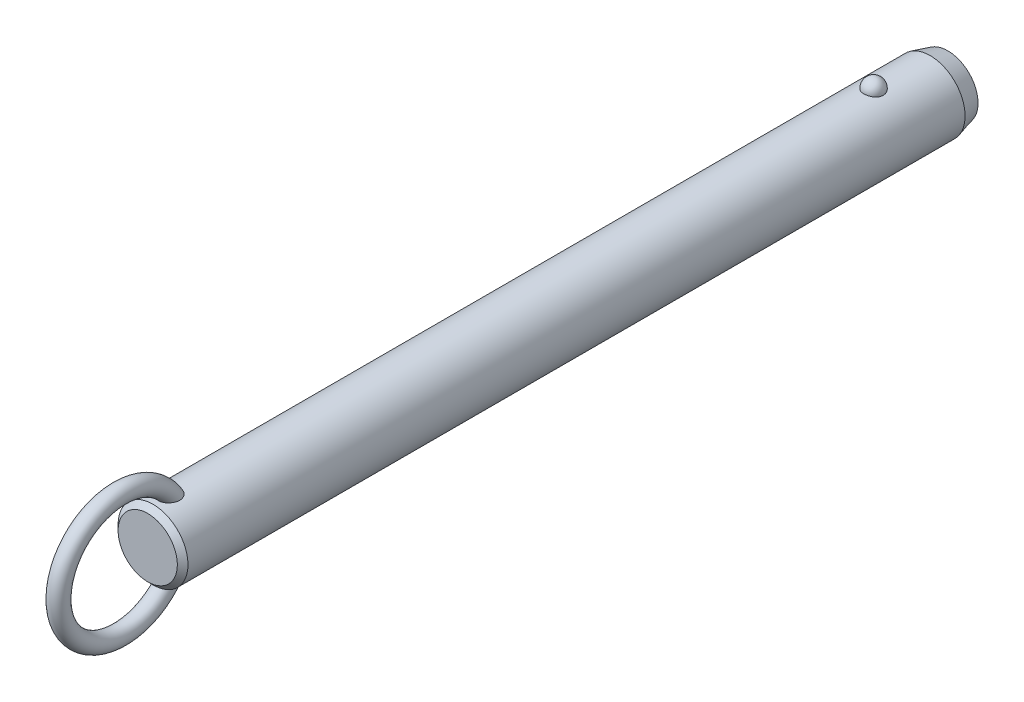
ISO-10303-21;
HEADER;
FILE_DESCRIPTION(('STEP AP214'),'2;1');
FILE_NAME('part.step','',(''),(''),'','','');
FILE_SCHEMA(('AUTOMOTIVE_DESIGN { 1 0 10303 214 1 1 1 1 }'));
ENDSEC;
DATA;
#1=APPLICATION_CONTEXT('core data for automotive mechanical design processes');
#2=APPLICATION_PROTOCOL_DEFINITION('international standard','automotive_design',2000,#1);
#3=PRODUCT_CONTEXT('',#1,'mechanical');
#4=PRODUCT('Part','Part','',(#3));
#5=PRODUCT_RELATED_PRODUCT_CATEGORY('part','',(#4));
#6=PRODUCT_DEFINITION_FORMATION('','',#4);
#7=PRODUCT_DEFINITION_CONTEXT('part definition',#1,'design');
#8=PRODUCT_DEFINITION('design','',#6,#7);
#9=PRODUCT_DEFINITION_SHAPE('','',#8);
#10=(LENGTH_UNIT() NAMED_UNIT(*) SI_UNIT(.MILLI.,.METRE.));
#11=(NAMED_UNIT(*) PLANE_ANGLE_UNIT() SI_UNIT($,.RADIAN.));
#12=(NAMED_UNIT(*) SI_UNIT($,.STERADIAN.) SOLID_ANGLE_UNIT());
#13=UNCERTAINTY_MEASURE_WITH_UNIT(LENGTH_MEASURE(1.E-05),#10,'distance_accuracy_value','');
#14=(GEOMETRIC_REPRESENTATION_CONTEXT(3) GLOBAL_UNCERTAINTY_ASSIGNED_CONTEXT((#13)) GLOBAL_UNIT_ASSIGNED_CONTEXT((#10,
#11,#12)) REPRESENTATION_CONTEXT('',''));
#15=CARTESIAN_POINT('',(0.,0.,0.));
#16=DIRECTION('',(0.,0.,1.));
#17=DIRECTION('',(1.,0.,0.));
#18=AXIS2_PLACEMENT_3D('',#15,#16,#17);
#19=CARTESIAN_POINT('',(0.,0.,152.4));
#20=DIRECTION('',(0.,0.,-1.));
#21=DIRECTION('',(-1.,0.,0.));
#22=AXIS2_PLACEMENT_3D('',#19,#20,#21);
#23=CYLINDRICAL_SURFACE('',#22,7.9);
#24=CARTESIAN_POINT('',(2.1785689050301,7.59367088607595,-2.19999999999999));
#25=CARTESIAN_POINT('',(2.17856679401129,7.59367269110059,-2.07701843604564));
#26=CARTESIAN_POINT('',(2.16853481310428,7.59657145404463,-1.95401006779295));
#27=CARTESIAN_POINT('',(2.12864689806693,7.607843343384,-1.71147811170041));
#28=CARTESIAN_POINT('',(2.09878338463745,7.61621856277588,-1.59195587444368));
#29=CARTESIAN_POINT('',(2.0199931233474,7.63749180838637,-1.3598563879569));
#30=CARTESIAN_POINT('',(1.97107475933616,7.65038784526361,-1.24727610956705));
#31=CARTESIAN_POINT('',(1.85539377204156,7.67926115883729,-1.03213234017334));
#32=CARTESIAN_POINT('',(1.78863158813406,7.69523835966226,-0.929568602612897));
#33=CARTESIAN_POINT('',(1.63856494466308,7.7285848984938,-0.736786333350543));
#34=CARTESIAN_POINT('',(1.55518140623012,7.7459606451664,-0.646630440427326));
#35=CARTESIAN_POINT('',(1.37422937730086,7.78009978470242,-0.481747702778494));
#36=CARTESIAN_POINT('',(1.27666086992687,7.79686317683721,-0.407020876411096));
#37=CARTESIAN_POINT('',(1.07024728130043,7.82786153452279,-0.275278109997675));
#38=CARTESIAN_POINT('',(0.961434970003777,7.84210353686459,-0.218212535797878));
#39=CARTESIAN_POINT('',(0.735351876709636,7.86652194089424,-0.123146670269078));
#40=CARTESIAN_POINT('',(0.618082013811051,7.87669878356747,-0.0851443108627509));
#41=CARTESIAN_POINT('',(0.380637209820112,7.89170521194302,-0.0298158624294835));
#42=CARTESIAN_POINT('',(0.260550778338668,7.89662650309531,-0.0121347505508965));
#43=CARTESIAN_POINT('',(0.019011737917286,7.90090003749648,0.00324379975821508));
#44=CARTESIAN_POINT('',(-0.10244074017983,7.90025280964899,0.000943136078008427));
#45=CARTESIAN_POINT('',(-0.341452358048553,7.89351056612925,-0.0233955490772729));
#46=CARTESIAN_POINT('',(-0.459042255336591,7.88749257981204,-0.0451545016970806));
#47=CARTESIAN_POINT('',(-0.688796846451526,7.87075812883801,-0.107408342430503));
#48=CARTESIAN_POINT('',(-0.800961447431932,7.86004158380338,-0.147903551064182));
#49=CARTESIAN_POINT('',(-1.01743634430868,7.83497131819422,-0.246799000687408));
#50=CARTESIAN_POINT('',(-1.12169791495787,7.82059709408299,-0.305300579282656));
#51=CARTESIAN_POINT('',(-1.31891765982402,7.78976470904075,-0.43854939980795));
#52=CARTESIAN_POINT('',(-1.41187469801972,7.77330633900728,-0.513298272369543));
#53=CARTESIAN_POINT('',(-1.58577142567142,7.73972434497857,-0.678622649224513));
#54=CARTESIAN_POINT('',(-1.66645140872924,7.72259402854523,-0.769470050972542));
#55=CARTESIAN_POINT('',(-1.81161503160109,7.68983776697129,-0.963538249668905));
#56=CARTESIAN_POINT('',(-1.87609753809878,7.6742119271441,-1.06675991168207));
#57=CARTESIAN_POINT('',(-1.98790138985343,7.6460202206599,-1.28401170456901));
#58=CARTESIAN_POINT('',(-2.03501994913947,7.63349104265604,-1.39815107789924));
#59=CARTESIAN_POINT('',(-2.10986724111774,7.6131449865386,-1.63301784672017));
#60=CARTESIAN_POINT('',(-2.1375965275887,7.60532797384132,-1.75374505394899));
#61=CARTESIAN_POINT('',(-2.17289256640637,7.5953195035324,-1.99782562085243));
#62=CARTESIAN_POINT('',(-2.18054294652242,7.59310471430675,-2.12116592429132));
#63=CARTESIAN_POINT('',(-2.17572919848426,7.59448538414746,-2.36741799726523));
#64=CARTESIAN_POINT('',(-2.1632656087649,7.59808068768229,-2.49032977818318));
#65=CARTESIAN_POINT('',(-2.11865035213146,7.61064035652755,-2.73161015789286));
#66=CARTESIAN_POINT('',(-2.08659579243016,7.61957823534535,-2.84999812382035));
#67=CARTESIAN_POINT('',(-2.00367799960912,7.64179982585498,-3.07955956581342));
#68=CARTESIAN_POINT('',(-1.9528140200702,7.65508371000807,-3.19073275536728));
#69=CARTESIAN_POINT('',(-1.83321113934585,7.68460381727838,-3.40337899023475));
#70=CARTESIAN_POINT('',(-1.76437735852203,7.70085556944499,-3.50479651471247));
#71=CARTESIAN_POINT('',(-1.61069526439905,7.73445734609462,-3.69446912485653));
#72=CARTESIAN_POINT('',(-1.52584634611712,7.75180741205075,-3.78272371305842));
#73=CARTESIAN_POINT('',(-1.34198059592,7.78574608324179,-3.94393987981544));
#74=CARTESIAN_POINT('',(-1.24291308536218,7.80233167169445,-4.01684434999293));
#75=CARTESIAN_POINT('',(-1.03352039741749,7.83281625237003,-4.14489386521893));
#76=CARTESIAN_POINT('',(-0.923196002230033,7.84671543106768,-4.20004014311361));
#77=CARTESIAN_POINT('',(-0.69582211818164,7.87011575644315,-4.29042017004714));
#78=CARTESIAN_POINT('',(-0.578872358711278,7.87966903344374,-4.32589112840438));
#79=CARTESIAN_POINT('',(-0.34041023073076,7.8935652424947,-4.37692226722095));
#80=CARTESIAN_POINT('',(-0.218898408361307,7.89790879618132,-4.39248482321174));
#81=CARTESIAN_POINT('',(0.0228107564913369,7.90087453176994,-4.40314405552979));
#82=CARTESIAN_POINT('',(0.142990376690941,7.89960185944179,-4.39861683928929));
#83=CARTESIAN_POINT('',(0.380829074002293,7.89171262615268,-4.37008293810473));
#84=CARTESIAN_POINT('',(0.498488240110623,7.8850962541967,-4.34607694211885));
#85=CARTESIAN_POINT('',(0.727535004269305,7.86726442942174,-4.27939317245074));
#86=CARTESIAN_POINT('',(0.838944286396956,7.85606616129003,-4.236785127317));
#87=CARTESIAN_POINT('',(1.05295421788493,7.83025654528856,-4.13408348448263));
#88=CARTESIAN_POINT('',(1.15555431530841,7.81564498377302,-4.07398879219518));
#89=CARTESIAN_POINT('',(1.35076763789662,7.7843022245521,-3.93687432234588));
#90=CARTESIAN_POINT('',(1.4432046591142,7.76754209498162,-3.85961036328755));
#91=CARTESIAN_POINT('',(1.6139111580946,7.73387857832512,-3.69076949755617));
#92=CARTESIAN_POINT('',(1.6921781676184,7.71697516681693,-3.59919010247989));
#93=CARTESIAN_POINT('',(1.83380875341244,7.6845643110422,-3.40247278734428));
#94=CARTESIAN_POINT('',(1.89689280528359,7.66908588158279,-3.29712873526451));
#95=CARTESIAN_POINT('',(2.0047823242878,7.64159441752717,-3.07707931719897));
#96=CARTESIAN_POINT('',(2.0495945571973,7.62958010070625,-2.96237743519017));
#97=CARTESIAN_POINT('',(2.11580183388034,7.61146617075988,-2.74040519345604));
#98=CARTESIAN_POINT('',(2.13929812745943,7.60484503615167,-2.63379846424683));
#99=CARTESIAN_POINT('',(2.17068242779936,7.59594664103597,-2.41813481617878));
#100=CARTESIAN_POINT('',(2.17857077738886,7.59366928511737,-2.30907795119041));
#101=CARTESIAN_POINT('',(2.1785689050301,7.59367088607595,-2.19999999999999));
#102=B_SPLINE_CURVE_WITH_KNOTS('',3,(#24,#25,#26,#27,#28,#29,#30,#31,#32,#33,#34,#35,#36,#37,
#38,#39,#40,#41,#42,#43,#44,#45,#46,#47,#48,#49,#50,#51,#52,#53,#54,#55,#56,#57,#58,#59,#60,#61,
#62,#63,#64,#65,#66,#67,#68,#69,#70,#71,#72,#73,#74,#75,#76,#77,#78,#79,#80,#81,#82,#83,#84,#85,
#86,#87,#88,#89,#90,#91,#92,#93,#94,#95,#96,#97,#98,#99,#100,#101),.UNSPECIFIED.,.T.,.F.,(4,2,2,
2,2,2,2,2,2,2,2,2,2,2,2,2,2,2,2,2,2,2,2,2,2,2,2,2,2,2,2,2,2,2,2,2,2,2,4),(0.,0.368552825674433,
0.737246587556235,1.10577831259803,1.4743009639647,1.84462067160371,2.21494081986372,
2.58421058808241,2.95344028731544,3.31611630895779,3.67875788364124,4.03628044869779,
4.39380913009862,4.75338791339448,5.11300280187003,5.47939989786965,5.8458226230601,
6.21639834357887,6.58696347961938,6.95598276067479,7.32499216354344,7.69218715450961,
8.0593967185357,8.42858578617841,8.79778880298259,9.16834203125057,9.5388695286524,
9.90482699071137,10.2707407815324,10.6298333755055,10.9889132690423,11.3466585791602,
11.7044262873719,12.0676511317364,12.4309391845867,12.8004764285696,13.1698767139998,
13.4967701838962,13.8236564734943),.UNSPECIFIED.);
#103=CARTESIAN_POINT('',(2.1785689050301,7.59367088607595,-2.19999999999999));
#104=VERTEX_POINT('',#103);
#105=EDGE_CURVE('E41',#104,#104,#102,.T.);
#106=ORIENTED_EDGE('',*,*,#105,.T.);
#107=EDGE_LOOP('',(#106));
#108=FACE_BOUND('',#107,.T.);
#109=CARTESIAN_POINT('',(0.,0.,160.72));
#110=DIRECTION('',(0.,0.,1.));
#111=DIRECTION('',(1.,0.,0.));
#112=AXIS2_PLACEMENT_3D('',#109,#110,#111);
#113=CIRCLE('',#112,7.9);
#114=CARTESIAN_POINT('',(7.9,0.,160.72));
#115=VERTEX_POINT('',#114);
#116=EDGE_CURVE('E10',#115,#115,#113,.F.);
#117=ORIENTED_EDGE('',*,*,#116,.T.);
#118=EDGE_LOOP('',(#117));
#119=FACE_BOUND('',#118,.T.);
#120=CARTESIAN_POINT('',(-0.630969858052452,-7.87476203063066,154.612432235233));
#121=CARTESIAN_POINT('',(-0.734180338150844,-7.86648998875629,154.647285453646));
#122=CARTESIAN_POINT('',(-0.834476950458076,-7.85639291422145,154.690816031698));
#123=CARTESIAN_POINT('',(-1.02620356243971,-7.83366343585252,154.794094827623));
#124=CARTESIAN_POINT('',(-1.1176141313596,-7.82102565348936,154.853877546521));
#125=CARTESIAN_POINT('',(-1.28877277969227,-7.79464922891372,154.987839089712));
#126=CARTESIAN_POINT('',(-1.36854014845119,-7.7809124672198,155.061993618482));
#127=CARTESIAN_POINT('',(-1.51461521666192,-7.75380398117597,155.222494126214));
#128=CARTESIAN_POINT('',(-1.58092966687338,-7.74043207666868,155.308833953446));
#129=CARTESIAN_POINT('',(-1.70019064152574,-7.7151252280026,155.492978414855));
#130=CARTESIAN_POINT('',(-1.75284037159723,-7.70322473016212,155.590979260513));
#131=CARTESIAN_POINT('',(-1.84263464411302,-7.68224112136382,155.794102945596));
#132=CARTESIAN_POINT('',(-1.87977299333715,-7.6731591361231,155.899228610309));
#133=CARTESIAN_POINT('',(-1.94152728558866,-7.65777930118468,156.123284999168));
#134=CARTESIAN_POINT('',(-1.96475471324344,-7.65179654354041,156.242616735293));
#135=CARTESIAN_POINT('',(-1.99449499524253,-7.64409642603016,156.48342986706));
#136=CARTESIAN_POINT('',(-2.0010005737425,-7.64238092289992,156.604912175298));
#137=CARTESIAN_POINT('',(-1.99856014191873,-7.64302120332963,156.868340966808));
#138=CARTESIAN_POINT('',(-1.98680021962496,-7.64611845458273,157.01025654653));
#139=CARTESIAN_POINT('',(-1.94457772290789,-7.65696186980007,157.291118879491));
#140=CARTESIAN_POINT('',(-1.91409393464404,-7.66471330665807,157.430062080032));
#141=CARTESIAN_POINT('',(-1.82768670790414,-7.68582947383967,157.731939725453));
#142=CARTESIAN_POINT('',(-1.76772963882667,-7.70003779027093,157.893686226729));
#143=CARTESIAN_POINT('',(-1.65998501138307,-7.72371550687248,158.127695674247));
#144=CARTESIAN_POINT('',(-1.621079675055,-7.73200670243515,158.204297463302));
#145=CARTESIAN_POINT('',(-1.53727726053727,-7.74910377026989,158.354079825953));
#146=CARTESIAN_POINT('',(-1.49238215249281,-7.75790947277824,158.427261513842));
#147=CARTESIAN_POINT('',(-1.37397050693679,-7.77993338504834,158.60288382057));
#148=CARTESIAN_POINT('',(-1.29690364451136,-7.79328473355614,158.702955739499));
#149=CARTESIAN_POINT('',(-1.1288548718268,-7.81939266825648,158.890714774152));
#150=CARTESIAN_POINT('',(-1.03789926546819,-7.83215032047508,158.978424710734));
#151=CARTESIAN_POINT('',(-0.869532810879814,-7.85231710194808,159.113414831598));
#152=CARTESIAN_POINT('',(-0.795716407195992,-7.86021093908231,159.165076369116));
#153=CARTESIAN_POINT('',(-0.640813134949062,-7.87434920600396,159.256381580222));
#154=CARTESIAN_POINT('',(-0.559737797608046,-7.88059619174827,159.29604389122));
#155=CARTESIAN_POINT('',(-0.406456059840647,-7.88984116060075,159.354300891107));
#156=CARTESIAN_POINT('',(-0.335227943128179,-7.89321892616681,159.375384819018));
#157=CARTESIAN_POINT('',(-0.190193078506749,-7.89804235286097,159.40541418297));
#158=CARTESIAN_POINT('',(-0.11638863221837,-7.89948969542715,159.414370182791));
#159=CARTESIAN_POINT('',(0.0318414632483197,-7.90028409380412,159.419291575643));
#160=CARTESIAN_POINT('',(0.106268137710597,-7.89962640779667,159.415227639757));
#161=CARTESIAN_POINT('',(0.253290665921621,-7.8962818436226,159.394461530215));
#162=CARTESIAN_POINT('',(0.325885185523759,-7.8935935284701,159.377750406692));
#163=CARTESIAN_POINT('',(0.481441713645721,-7.88577340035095,159.328738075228));
#164=CARTESIAN_POINT('',(0.563611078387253,-7.88026321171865,159.294005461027));
#165=CARTESIAN_POINT('',(0.721129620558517,-7.86741729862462,159.211796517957));
#166=CARTESIAN_POINT('',(0.79646633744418,-7.86007832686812,159.164297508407));
#167=CARTESIAN_POINT('',(0.971456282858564,-7.84073285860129,159.036513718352));
#168=CARTESIAN_POINT('',(1.0671968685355,-7.82809461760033,158.951004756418));
#169=CARTESIAN_POINT('',(1.24418921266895,-7.80192439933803,158.766232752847));
#170=CARTESIAN_POINT('',(1.32540832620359,-7.78839049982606,158.666939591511));
#171=CARTESIAN_POINT('',(1.45199971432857,-7.76559693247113,158.489576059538));
#172=CARTESIAN_POINT('',(1.5008564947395,-7.75626094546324,158.413954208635));
#173=CARTESIAN_POINT('',(1.59197749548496,-7.7380727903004,158.258742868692));
#174=CARTESIAN_POINT('',(1.63423919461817,-7.72922080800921,158.179151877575));
#175=CARTESIAN_POINT('',(1.71222612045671,-7.71231959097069,158.016664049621));
#176=CARTESIAN_POINT('',(1.74794516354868,-7.70427111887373,157.933764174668));
#177=CARTESIAN_POINT('',(1.81270113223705,-7.68929240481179,157.7652967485));
#178=CARTESIAN_POINT('',(1.84173789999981,-7.68236218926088,157.679729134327));
#179=CARTESIAN_POINT('',(1.89322698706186,-7.6698375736,157.50528702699));
#180=CARTESIAN_POINT('',(1.91558744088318,-7.66426199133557,157.416383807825));
#181=CARTESIAN_POINT('',(1.95281367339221,-7.65485915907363,157.236969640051));
#182=CARTESIAN_POINT('',(1.96767946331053,-7.65103190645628,157.146458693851));
#183=CARTESIAN_POINT('',(2.00021456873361,-7.64262981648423,156.873732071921));
#184=CARTESIAN_POINT('',(2.00600691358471,-7.6410871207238,156.689709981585));
#185=CARTESIAN_POINT('',(1.98445334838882,-7.64669564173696,156.376501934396));
#186=CARTESIAN_POINT('',(1.96607186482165,-7.65149688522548,156.246618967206));
#187=CARTESIAN_POINT('',(1.90884967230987,-7.6659762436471,155.991632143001));
#188=CARTESIAN_POINT('',(1.87002101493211,-7.67565148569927,155.866525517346));
#189=CARTESIAN_POINT('',(1.77063986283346,-7.69918471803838,155.62454013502));
#190=CARTESIAN_POINT('',(1.70993724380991,-7.71307150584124,155.507725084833));
#191=CARTESIAN_POINT('',(1.56733070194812,-7.74330306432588,155.288144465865));
#192=CARTESIAN_POINT('',(1.48543692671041,-7.75964665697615,155.185372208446));
#193=CARTESIAN_POINT('',(1.31346177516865,-7.79047523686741,155.009380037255));
#194=CARTESIAN_POINT('',(1.22547278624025,-7.80495298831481,154.934106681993));
#195=CARTESIAN_POINT('',(1.03724352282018,-7.83218597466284,154.800486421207));
#196=CARTESIAN_POINT('',(0.93700840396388,-7.84494192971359,154.742132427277));
#197=CARTESIAN_POINT('',(0.733599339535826,-7.86649045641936,154.647027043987));
#198=CARTESIAN_POINT('',(0.630941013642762,-7.87547134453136,154.609210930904));
#199=CARTESIAN_POINT('',(0.420465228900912,-7.88950708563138,154.551116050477));
#200=CARTESIAN_POINT('',(0.312645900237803,-7.89456050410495,154.53084369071));
#201=CARTESIAN_POINT('',(0.0960869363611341,-7.9001518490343,154.508455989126));
#202=CARTESIAN_POINT('',(-0.0126341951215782,-7.90073226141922,154.506169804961));
#203=CARTESIAN_POINT('',(-0.228766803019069,-7.89742350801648,154.519367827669));
#204=CARTESIAN_POINT('',(-0.336180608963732,-7.89354403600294,154.534813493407));
#205=CARTESIAN_POINT('',(-0.47341099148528,-7.88586871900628,154.566217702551));
#206=CARTESIAN_POINT('',(-0.505257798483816,-7.88388984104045,154.574354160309));
#207=CARTESIAN_POINT('',(-0.568481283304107,-7.87958326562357,154.592208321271));
#208=CARTESIAN_POINT('',(-0.599857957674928,-7.87725556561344,154.601926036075));
#209=CARTESIAN_POINT('',(-0.630969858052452,-7.87476203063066,154.612432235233));
#210=B_SPLINE_CURVE_WITH_KNOTS('',3,(#120,#121,#122,#123,#124,#125,#126,#127,#128,#129,#130,
#131,#132,#133,#134,#135,#136,#137,#138,#139,#140,#141,#142,#143,#144,#145,#146,#147,#148,#149,
#150,#151,#152,#153,#154,#155,#156,#157,#158,#159,#160,#161,#162,#163,#164,#165,#166,#167,#168,
#169,#170,#171,#172,#173,#174,#175,#176,#177,#178,#179,#180,#181,#182,#183,#184,#185,#186,#187,
#188,#189,#190,#191,#192,#193,#194,#195,#196,#197,#198,#199,#200,#201,#202,#203,#204,#205,#206,
#207,#208,#209),.UNSPECIFIED.,.T.,.F.,(4,2,2,2,2,2,2,2,2,2,2,2,2,2,2,2,2,2,2,2,2,2,2,2,2,2,2,2,
2,2,2,2,2,2,2,2,2,2,2,2,2,2,2,2,4),(0.,0.327622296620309,0.655945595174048,0.98371863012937,
1.3113267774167,1.64554655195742,1.97989964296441,2.34365728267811,2.70757317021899,
3.13333684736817,3.55958380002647,4.07655306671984,4.33527897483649,4.59391999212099,
4.97382437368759,5.353017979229,5.62348245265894,5.89352465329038,6.11565959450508,
6.33760092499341,6.56004255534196,6.78264174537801,7.04930844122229,7.31645206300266,
7.70130871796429,8.08701995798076,8.35824509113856,8.62957365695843,8.90115735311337,
9.1727474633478,9.44791855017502,9.72308922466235,10.2715298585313,10.6638393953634,
11.0559179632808,11.4507403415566,11.8453740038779,12.1936425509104,12.5417649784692,
12.8695063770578,13.1973674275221,13.5221104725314,13.8461490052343,13.9449071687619,
14.0436660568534),.UNSPECIFIED.);
#211=CARTESIAN_POINT('',(-0.630969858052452,-7.87476203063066,154.612432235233));
#212=VERTEX_POINT('',#211);
#213=EDGE_CURVE('E59',#212,#212,#210,.T.);
#214=ORIENTED_EDGE('',*,*,#213,.T.);
#215=EDGE_LOOP('',(#214));
#216=FACE_BOUND('',#215,.T.);
#217=CARTESIAN_POINT('',(-0.630969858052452,7.87476203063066,154.612432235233));
#218=CARTESIAN_POINT('',(-0.52891882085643,7.88293636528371,154.577979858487));
#219=CARTESIAN_POINT('',(-0.423745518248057,7.88934810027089,154.551915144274));
#220=CARTESIAN_POINT('',(-0.210236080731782,7.8979273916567,154.517282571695));
#221=CARTESIAN_POINT('',(-0.101893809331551,7.90008607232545,154.508751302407));
#222=CARTESIAN_POINT('',(0.11466056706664,7.89990877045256,154.509457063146));
#223=CARTESIAN_POINT('',(0.222872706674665,7.89757640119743,154.51867980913));
#224=CARTESIAN_POINT('',(0.436107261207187,7.88867538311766,154.554652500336));
#225=CARTESIAN_POINT('',(0.541131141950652,7.8821087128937,154.58139425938));
#226=CARTESIAN_POINT('',(0.745085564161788,7.86545130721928,154.651756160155));
#227=CARTESIAN_POINT('',(0.844015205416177,7.85536005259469,154.695378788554));
#228=CARTESIAN_POINT('',(1.03299167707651,7.83275153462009,154.798379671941));
#229=CARTESIAN_POINT('',(1.12303841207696,7.8202342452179,154.857758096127));
#230=CARTESIAN_POINT('',(1.29214734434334,7.79408219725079,154.990864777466));
#231=CARTESIAN_POINT('',(1.37116907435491,7.78044359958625,155.064643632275));
#232=CARTESIAN_POINT('',(1.51597677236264,7.75353170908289,155.224235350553));
#233=CARTESIAN_POINT('',(1.58176261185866,7.74025841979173,155.310048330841));
#234=CARTESIAN_POINT('',(1.70057386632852,7.71504069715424,155.493644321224));
#235=CARTESIAN_POINT('',(1.75320073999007,7.7031425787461,155.591690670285));
#236=CARTESIAN_POINT('',(1.8429376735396,7.68216822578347,155.794893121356));
#237=CARTESIAN_POINT('',(1.88004278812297,7.67309289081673,155.900051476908));
#238=CARTESIAN_POINT('',(1.9417232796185,7.6577294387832,156.124167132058));
#239=CARTESIAN_POINT('',(1.96491037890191,7.65175648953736,156.243524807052));
#240=CARTESIAN_POINT('',(1.9945689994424,7.64407702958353,156.484384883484));
#241=CARTESIAN_POINT('',(2.00103304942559,7.64237242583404,156.60588821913));
#242=CARTESIAN_POINT('',(1.99850166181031,7.64303650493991,156.869368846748));
#243=CARTESIAN_POINT('',(1.98669038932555,7.64614714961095,157.011314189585));
#244=CARTESIAN_POINT('',(1.94436120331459,7.6570170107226,157.292228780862));
#245=CARTESIAN_POINT('',(1.91382203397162,7.66478150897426,157.431194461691));
#246=CARTESIAN_POINT('',(1.82728754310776,7.68592483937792,157.733111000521));
#247=CARTESIAN_POINT('',(1.76725778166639,7.7001468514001,157.894872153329));
#248=CARTESIAN_POINT('',(1.65939700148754,7.72384204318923,158.128891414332));
#249=CARTESIAN_POINT('',(1.62045187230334,7.73213852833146,158.205494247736));
#250=CARTESIAN_POINT('',(1.53656684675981,7.74924489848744,158.355273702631));
#251=CARTESIAN_POINT('',(1.49162892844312,7.75805461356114,158.428451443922));
#252=CARTESIAN_POINT('',(1.37317698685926,7.78007342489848,158.603952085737));
#253=CARTESIAN_POINT('',(1.29612360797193,7.79341423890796,158.703911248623));
#254=CARTESIAN_POINT('',(1.12812043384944,7.81949839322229,158.89145083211));
#255=CARTESIAN_POINT('',(1.03719688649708,7.83224280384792,158.979054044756));
#256=CARTESIAN_POINT('',(0.868871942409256,7.85239026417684,159.11389715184));
#257=CARTESIAN_POINT('',(0.795056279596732,7.86027769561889,159.165511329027));
#258=CARTESIAN_POINT('',(0.640160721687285,7.87440222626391,159.256720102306));
#259=CARTESIAN_POINT('',(0.559092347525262,7.88064188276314,159.296333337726));
#260=CARTESIAN_POINT('',(0.405820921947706,7.8898738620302,159.354505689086));
#261=CARTESIAN_POINT('',(0.334594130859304,7.89324577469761,159.375552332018));
#262=CARTESIAN_POINT('',(0.189568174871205,7.89805733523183,159.405507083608));
#263=CARTESIAN_POINT('',(0.115771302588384,7.89949866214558,159.414425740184));
#264=CARTESIAN_POINT('',(-0.0324359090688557,7.90028156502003,159.41927589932));
#265=CARTESIAN_POINT('',(-0.106847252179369,7.89961843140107,159.415178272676));
#266=CARTESIAN_POINT('',(-0.253834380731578,7.8962642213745,159.394351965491));
#267=CARTESIAN_POINT('',(-0.326408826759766,7.89357170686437,159.377614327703));
#268=CARTESIAN_POINT('',(-0.481962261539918,7.88574179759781,159.328539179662));
#269=CARTESIAN_POINT('',(-0.564145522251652,7.88022507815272,159.293763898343));
#270=CARTESIAN_POINT('',(-0.721685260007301,7.86736646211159,159.211468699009));
#271=CARTESIAN_POINT('',(-0.79702924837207,7.8600213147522,159.163926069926));
#272=CARTESIAN_POINT('',(-0.972044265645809,7.84066026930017,159.036026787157));
#273=CARTESIAN_POINT('',(-1.06779803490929,7.828012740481,158.950443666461));
#274=CARTESIAN_POINT('',(-1.24480531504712,7.80182621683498,158.765522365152));
#275=CARTESIAN_POINT('',(-1.32602618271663,7.78828530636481,158.666154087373));
#276=CARTESIAN_POINT('',(-1.4525983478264,7.76548487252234,158.488680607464));
#277=CARTESIAN_POINT('',(-1.50143856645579,7.75614818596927,158.413025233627));
#278=CARTESIAN_POINT('',(-1.59252410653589,7.73796020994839,158.257748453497));
#279=CARTESIAN_POINT('',(-1.63476690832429,7.729109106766,158.178125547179));
#280=CARTESIAN_POINT('',(-1.7127131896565,7.71221133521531,158.015575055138));
#281=CARTESIAN_POINT('',(-1.74841047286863,7.70416543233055,157.932644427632));
#282=CARTESIAN_POINT('',(-1.81311929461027,7.6891937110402,157.764116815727));
#283=CARTESIAN_POINT('',(-1.84213067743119,7.68226791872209,157.678519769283));
#284=CARTESIAN_POINT('',(-1.89356259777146,7.66975461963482,157.504025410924));
#285=CARTESIAN_POINT('',(-1.91589165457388,7.66418586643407,157.415099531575));
#286=CARTESIAN_POINT('',(-1.9530507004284,7.65479859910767,157.235642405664));
#287=CARTESIAN_POINT('',(-1.96788069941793,7.65098008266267,157.145111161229));
#288=CARTESIAN_POINT('',(-2.00030078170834,7.64260704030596,156.872327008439));
#289=CARTESIAN_POINT('',(-2.00600576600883,7.64108760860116,156.688271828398));
#290=CARTESIAN_POINT('',(-1.9842848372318,7.64673945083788,156.375080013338));
#291=CARTESIAN_POINT('',(-1.96583698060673,7.65155751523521,156.245240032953));
#292=CARTESIAN_POINT('',(-1.90848948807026,7.66606613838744,155.990361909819));
#293=CARTESIAN_POINT('',(-1.86960376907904,7.67575338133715,155.865320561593));
#294=CARTESIAN_POINT('',(-1.77013421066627,7.6993013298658,155.623500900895));
#295=CARTESIAN_POINT('',(-1.70940488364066,7.71318991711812,155.506784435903));
#296=CARTESIAN_POINT('',(-1.5667295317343,7.74342495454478,155.287340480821));
#297=CARTESIAN_POINT('',(-1.48478316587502,7.75977144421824,155.18461321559));
#298=CARTESIAN_POINT('',(-1.31266325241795,7.79061163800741,155.008643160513));
#299=CARTESIAN_POINT('',(-1.22456383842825,7.80509908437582,154.933358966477));
#300=CARTESIAN_POINT('',(-1.03622400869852,7.83231881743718,154.799865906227));
#301=CARTESIAN_POINT('',(-0.936015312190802,7.84505551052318,154.741613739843));
#302=CARTESIAN_POINT('',(-0.798824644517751,7.85957802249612,154.677540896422));
#303=CARTESIAN_POINT('',(-0.765787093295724,7.86286821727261,154.663224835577));
#304=CARTESIAN_POINT('',(-0.698939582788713,7.86909211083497,154.636436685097));
#305=CARTESIAN_POINT('',(-0.665129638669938,7.8720258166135,154.623964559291));
#306=CARTESIAN_POINT('',(-0.630969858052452,7.87476203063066,154.612432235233));
#307=B_SPLINE_CURVE_WITH_KNOTS('',3,(#217,#218,#219,#220,#221,#222,#223,#224,#225,#226,#227,
#228,#229,#230,#231,#232,#233,#234,#235,#236,#237,#238,#239,#240,#241,#242,#243,#244,#245,#246,
#247,#248,#249,#250,#251,#252,#253,#254,#255,#256,#257,#258,#259,#260,#261,#262,#263,#264,#265,
#266,#267,#268,#269,#270,#271,#272,#273,#274,#275,#276,#277,#278,#279,#280,#281,#282,#283,#284,
#285,#286,#287,#288,#289,#290,#291,#292,#293,#294,#295,#296,#297,#298,#299,#300,#301,#302,#303,
#304,#305,#306),.UNSPECIFIED.,.T.,.F.,(4,2,2,2,2,2,2,2,2,2,2,2,2,2,2,2,2,2,2,2,2,2,2,2,2,2,2,2,
2,2,2,2,2,2,2,2,2,2,2,2,2,2,2,2,4),(0.,0.32392037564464,0.648516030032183,0.972850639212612,
1.29703380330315,1.62126473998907,1.94549915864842,2.27089401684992,2.59629203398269,
2.93059633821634,3.26500707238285,3.6288164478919,3.99278833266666,4.41865421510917,
4.84500434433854,5.36209210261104,5.62087589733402,5.87957448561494,6.25918598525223,
6.63808782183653,6.90846748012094,7.17842501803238,7.40052350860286,7.6224287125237,
7.84483086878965,8.0673907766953,8.33414615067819,8.60137921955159,8.98641454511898,
9.37230415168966,9.6435867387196,9.91497268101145,10.1866142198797,10.4582620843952,
10.7334745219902,11.008686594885,11.5572126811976,11.9494246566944,12.3413699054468,
12.7359755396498,13.1305875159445,13.4791770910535,13.82687259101,13.9353013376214,
14.0437279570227),.UNSPECIFIED.);
#308=CARTESIAN_POINT('',(-0.630969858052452,7.87476203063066,154.612432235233));
#309=VERTEX_POINT('',#308);
#310=EDGE_CURVE('E67',#309,#309,#307,.T.);
#311=ORIENTED_EDGE('',*,*,#310,.T.);
#312=EDGE_LOOP('',(#311));
#313=FACE_BOUND('',#312,.T.);
#314=CARTESIAN_POINT('',(0.,0.,-15.0000000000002));
#315=DIRECTION('',(0.,0.,-1.));
#316=DIRECTION('',(-1.,0.,0.));
#317=AXIS2_PLACEMENT_3D('',#314,#315,#316);
#318=CIRCLE('',#317,7.9);
#319=CARTESIAN_POINT('',(-7.9,0.,-15.0000000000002));
#320=VERTEX_POINT('',#319);
#321=EDGE_CURVE('E56',#320,#320,#318,.F.);
#322=ORIENTED_EDGE('',*,*,#321,.T.);
#323=EDGE_LOOP('',(#322));
#324=FACE_BOUND('',#323,.T.);
#325=ADVANCED_FACE('F37',(#108,#119,#216,#313,#324),#23,.T.);
#326=CARTESIAN_POINT('',(0.,0.,-19.));
#327=DIRECTION('',(0.,0.,-1.));
#328=DIRECTION('',(-1.,0.,0.));
#329=AXIS2_PLACEMENT_3D('',#326,#327,#328);
#330=PLANE('',#329);
#331=CARTESIAN_POINT('',(0.,0.,-19.));
#332=DIRECTION('',(0.,0.,-1.));
#333=DIRECTION('',(-1.,0.,0.));
#334=AXIS2_PLACEMENT_3D('',#331,#332,#333);
#335=CIRCLE('',#334,6.82820323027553);
#336=CARTESIAN_POINT('',(-6.82820323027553,0.,-19.));
#337=VERTEX_POINT('',#336);
#338=EDGE_CURVE('E66',#337,#337,#335,.T.);
#339=ORIENTED_EDGE('',*,*,#338,.T.);
#340=EDGE_LOOP('',(#339));
#341=FACE_BOUND('',#340,.T.);
#342=ADVANCED_FACE('F85',(#341),#330,.T.);
#343=CARTESIAN_POINT('',(0.,0.,-19.));
#344=DIRECTION('',(0.,0.,1.));
#345=DIRECTION('',(1.,0.,0.));
#346=AXIS2_PLACEMENT_3D('',#343,#344,#345);
#347=CONICAL_SURFACE('',#346,6.82820323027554,0.261799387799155);
#348=ORIENTED_EDGE('',*,*,#321,.F.);
#349=EDGE_LOOP('',(#348));
#350=FACE_BOUND('',#349,.T.);
#351=ORIENTED_EDGE('',*,*,#338,.F.);
#352=EDGE_LOOP('',(#351));
#353=FACE_BOUND('',#352,.T.);
#354=ADVANCED_FACE('F83',(#350,#353),#347,.T.);
#355=CARTESIAN_POINT('',(0.,0.,161.92));
#356=DIRECTION('',(0.,0.,1.));
#357=DIRECTION('',(1.,0.,0.));
#358=AXIS2_PLACEMENT_3D('',#355,#356,#357);
#359=PLANE('',#358);
#360=CARTESIAN_POINT('',(0.,0.,161.92));
#361=DIRECTION('',(0.,0.,1.));
#362=DIRECTION('',(1.,0.,0.));
#363=AXIS2_PLACEMENT_3D('',#360,#361,#362);
#364=CIRCLE('',#363,6.70000000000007);
#365=CARTESIAN_POINT('',(6.70000000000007,0.,161.92));
#366=VERTEX_POINT('',#365);
#367=EDGE_CURVE('E50',#366,#366,#364,.T.);
#368=ORIENTED_EDGE('',*,*,#367,.T.);
#369=EDGE_LOOP('',(#368));
#370=FACE_BOUND('',#369,.T.);
#371=ADVANCED_FACE('F77',(#370),#359,.T.);
#372=CARTESIAN_POINT('',(0.,0.,168.25));
#373=DIRECTION('',(1.,0.,0.));
#374=DIRECTION('',(0.,0.,-1.));
#375=AXIS2_PLACEMENT_3D('',#372,#373,#374);
#376=TOROIDAL_SURFACE('',#375,13.85,2.);
#377=ORIENTED_EDGE('',*,*,#310,.F.);
#378=EDGE_LOOP('',(#377));
#379=FACE_BOUND('',#378,.T.);
#380=ORIENTED_EDGE('',*,*,#213,.F.);
#381=EDGE_LOOP('',(#380));
#382=FACE_BOUND('',#381,.T.);
#383=ADVANCED_FACE('F73',(#379,#382),#376,.T.);
#384=CARTESIAN_POINT('',(0.,0.,161.92));
#385=DIRECTION('',(0.,0.,-1.));
#386=DIRECTION('',(-1.,0.,0.));
#387=AXIS2_PLACEMENT_3D('',#384,#385,#386);
#388=CONICAL_SURFACE('',#387,6.70000000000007,0.785398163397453);
#389=ORIENTED_EDGE('',*,*,#116,.F.);
#390=EDGE_LOOP('',(#389));
#391=FACE_BOUND('',#390,.T.);
#392=ORIENTED_EDGE('',*,*,#367,.F.);
#393=EDGE_LOOP('',(#392));
#394=FACE_BOUND('',#393,.T.);
#395=ADVANCED_FACE('F39',(#391,#394),#388,.T.);
#396=CARTESIAN_POINT('',(0.,7.9,-2.19999999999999));
#397=DIRECTION('',(0.,1.,0.));
#398=DIRECTION('',(0.,0.,-1.));
#399=AXIS2_PLACEMENT_3D('',#396,#397,#398);
#400=SPHERICAL_SURFACE('',#399,2.2);
#401=ORIENTED_EDGE('',*,*,#105,.F.);
#402=EDGE_LOOP('',(#401));
#403=FACE_BOUND('',#402,.T.);
#404=ADVANCED_FACE('F79',(#403),#400,.T.);
#405=CLOSED_SHELL('',(#325,#342,#354,#371,#383,#395,#404));
#406=MANIFOLD_SOLID_BREP('B2',#405);
#407=ADVANCED_BREP_SHAPE_REPRESENTATION('',(#18,#406),#14);
#408=SHAPE_DEFINITION_REPRESENTATION(#9,#407);
ENDSEC;
END-ISO-10303-21;
